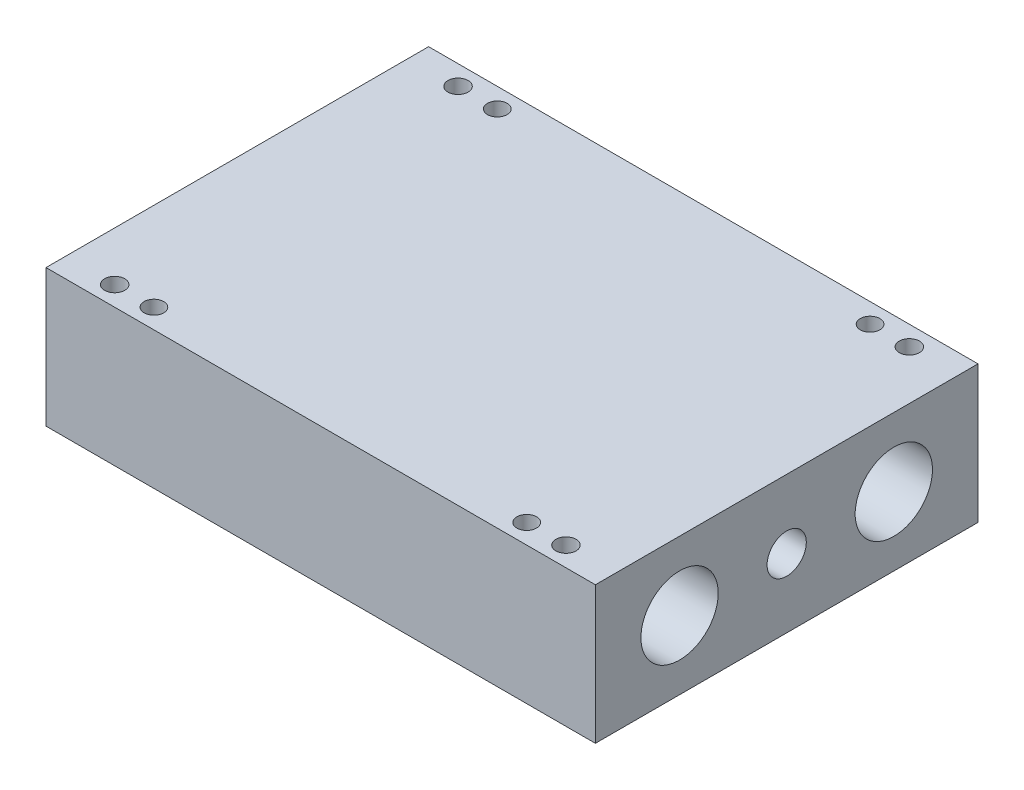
from build123d import *

# Parameters (mm, degrees)
SKETCH1_W                    = 123.825
SKETCH1_H                    = 44.45
EXTRUDE1_DEPTH               = 88.9
F_5_16_18_TAPPED_HOLE1_D     = 6.5278
F_5_16_18_TAPPED_HOLE1_DEPTH = 19.7612
F_5_16_18_TAPPED_HOLE1_TIP   = 1.961148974
HOLE1_D                      = 6.35
SKETCH6_R                    = 12.5095
SKETCH6_R_2                  = 6.35
CUT_EXTRUDE1_DEPTH           = 190.578343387


with BuildPart() as part:
    # Sketch1 → Extrude1 (new, symmetric)
    with BuildSketch(Plane(origin=(0, 0, 0), x_dir=(0, 0, -1), z_dir=(1, 0, 0))):
        Rectangle(SKETCH1_W, SKETCH1_H)
    extrude(amount=EXTRUDE1_DEPTH, both=True)

    # 5_16-18 Tapped Hole1
    with Locations(Plane(origin=(0, 22.225, 0), x_dir=(1, 0, 0), z_dir=(0, 1, 0))):
        with Locations((-73.025, 55.5625), (73.025, 55.5625), (73.025, -55.5625), (-73.025, -55.5625)):
            Hole(F_5_16_18_TAPPED_HOLE1_D / 2, depth=F_5_16_18_TAPPED_HOLE1_DEPTH)
            with Locations((0, 0, -(F_5_16_18_TAPPED_HOLE1_DEPTH + F_5_16_18_TAPPED_HOLE1_TIP / 2))):  # 118° drill point
                Cone(0, F_5_16_18_TAPPED_HOLE1_D / 2, F_5_16_18_TAPPED_HOLE1_TIP, mode=Mode.SUBTRACT)

    # Hole1 (through all)
    with Locations(Plane(origin=(0, 22.225, 0), x_dir=(1, 0, 0), z_dir=(0, 1, 0))):
        with Locations((-60.325, 55.5625), (60.325, 55.5625), (60.325, -55.5625), (-60.325, -55.5625)):
            Hole(HOLE1_D / 2)

    # Sketch6 → Cut-Extrude1 (cut, through all)
    with BuildSketch(Plane(origin=(88.9, 0, 0), x_dir=(0, 0, -1), z_dir=(1, 0, 0))):
        with Locations((-34.671, 0)):
            Circle(SKETCH6_R)
        Circle(SKETCH6_R_2)
        with Locations((34.671, 0)):
            Circle(SKETCH6_R)
    extrude(amount=-CUT_EXTRUDE1_DEPTH, mode=Mode.SUBTRACT)


solid = part.part
